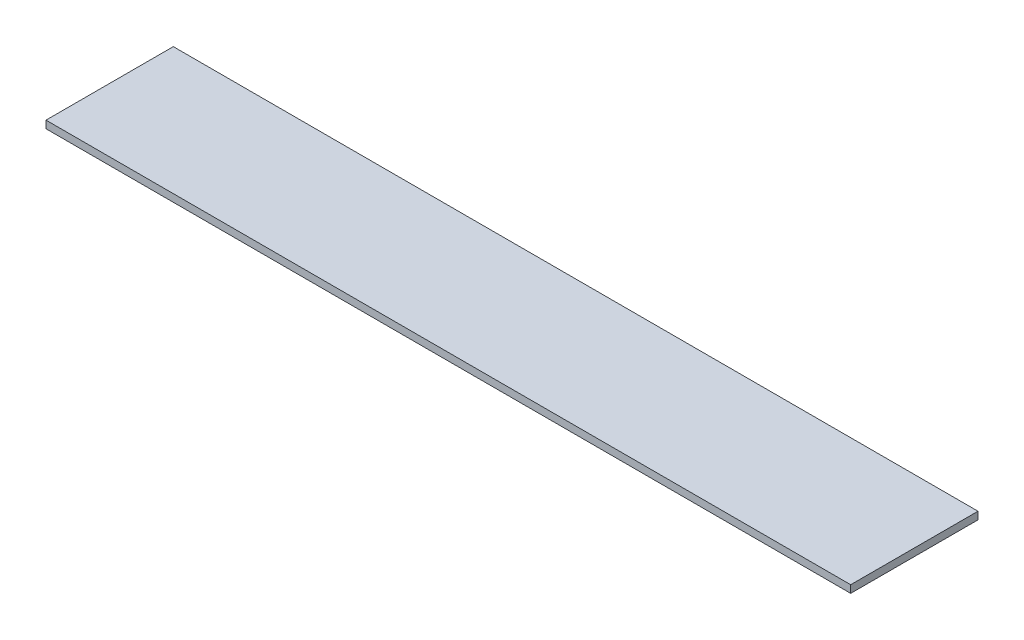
ISO-10303-21;
HEADER;
FILE_DESCRIPTION(('STEP AP214'),'2;1');
FILE_NAME('part.step','',(''),(''),'','','');
FILE_SCHEMA(('AUTOMOTIVE_DESIGN { 1 0 10303 214 1 1 1 1 }'));
ENDSEC;
DATA;
#1=APPLICATION_CONTEXT('core data for automotive mechanical design processes');
#2=APPLICATION_PROTOCOL_DEFINITION('international standard','automotive_design',2000,#1);
#3=PRODUCT_CONTEXT('',#1,'mechanical');
#4=PRODUCT('Part','Part','',(#3));
#5=PRODUCT_RELATED_PRODUCT_CATEGORY('part','',(#4));
#6=PRODUCT_DEFINITION_FORMATION('','',#4);
#7=PRODUCT_DEFINITION_CONTEXT('part definition',#1,'design');
#8=PRODUCT_DEFINITION('design','',#6,#7);
#9=PRODUCT_DEFINITION_SHAPE('','',#8);
#10=(LENGTH_UNIT() NAMED_UNIT(*) SI_UNIT(.MILLI.,.METRE.));
#11=(NAMED_UNIT(*) PLANE_ANGLE_UNIT() SI_UNIT($,.RADIAN.));
#12=(NAMED_UNIT(*) SI_UNIT($,.STERADIAN.) SOLID_ANGLE_UNIT());
#13=UNCERTAINTY_MEASURE_WITH_UNIT(LENGTH_MEASURE(1.E-05),#10,'distance_accuracy_value','');
#14=(GEOMETRIC_REPRESENTATION_CONTEXT(3) GLOBAL_UNCERTAINTY_ASSIGNED_CONTEXT((#13)) GLOBAL_UNIT_ASSIGNED_CONTEXT((#10,
#11,#12)) REPRESENTATION_CONTEXT('',''));
#15=CARTESIAN_POINT('',(0.,0.,0.));
#16=DIRECTION('',(0.,0.,1.));
#17=DIRECTION('',(1.,0.,0.));
#18=AXIS2_PLACEMENT_3D('',#15,#16,#17);
#19=CARTESIAN_POINT('',(0.,0.,26.924));
#20=DIRECTION('',(0.,0.,1.));
#21=DIRECTION('',(1.,0.,0.));
#22=AXIS2_PLACEMENT_3D('',#19,#20,#21);
#23=PLANE('',#22);
#24=DIRECTION('',(1.,0.,0.));
#25=VECTOR('',#24,1.);
#26=CARTESIAN_POINT('',(-209.826086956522,45.0420093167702,26.924));
#27=LINE('',#26,#25);
#28=CARTESIAN_POINT('',(-209.826086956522,45.0420093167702,26.924));
#29=VERTEX_POINT('',#28);
#30=CARTESIAN_POINT('',(-39.6460869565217,45.0420093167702,26.924));
#31=VERTEX_POINT('',#30);
#32=EDGE_CURVE('E92',#29,#31,#27,.T.);
#33=ORIENTED_EDGE('',*,*,#32,.F.);
#34=DIRECTION('',(0.,-1.,0.));
#35=VECTOR('',#34,1.);
#36=CARTESIAN_POINT('',(-209.826086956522,67.8385093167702,26.924));
#37=LINE('',#36,#35);
#38=CARTESIAN_POINT('',(-209.826086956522,43.4545093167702,26.924));
#39=VERTEX_POINT('',#38);
#40=EDGE_CURVE('E82',#29,#39,#37,.T.);
#41=ORIENTED_EDGE('',*,*,#40,.T.);
#42=DIRECTION('',(1.,0.,0.));
#43=VECTOR('',#42,1.);
#44=CARTESIAN_POINT('',(-209.826086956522,43.4545093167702,26.924));
#45=LINE('',#44,#43);
#46=CARTESIAN_POINT('',(-39.6460869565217,43.4545093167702,26.924));
#47=VERTEX_POINT('',#46);
#48=EDGE_CURVE('E54',#39,#47,#45,.T.);
#49=ORIENTED_EDGE('',*,*,#48,.T.);
#50=DIRECTION('',(0.,1.,0.));
#51=VECTOR('',#50,1.);
#52=CARTESIAN_POINT('',(-39.6460869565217,67.8385093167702,26.924));
#53=LINE('',#52,#51);
#54=EDGE_CURVE('E100',#47,#31,#53,.T.);
#55=ORIENTED_EDGE('',*,*,#54,.T.);
#56=EDGE_LOOP('',(#33,#41,#49,#55));
#57=FACE_BOUND('',#56,.T.);
#58=ADVANCED_FACE('F37',(#57),#23,.T.);
#59=CARTESIAN_POINT('',(-209.826086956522,67.8385093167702,26.924));
#60=DIRECTION('',(1.,0.,0.));
#61=DIRECTION('',(0.,0.,-1.));
#62=AXIS2_PLACEMENT_3D('',#59,#60,#61);
#63=PLANE('',#62);
#64=DIRECTION('',(0.,0.,1.));
#65=VECTOR('',#64,1.);
#66=CARTESIAN_POINT('',(-209.826086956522,45.0420093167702,-168.891741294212));
#67=LINE('',#66,#65);
#68=CARTESIAN_POINT('',(-209.826086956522,45.0420093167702,0.));
#69=VERTEX_POINT('',#68);
#70=EDGE_CURVE('E73',#69,#29,#67,.T.);
#71=ORIENTED_EDGE('',*,*,#70,.F.);
#72=DIRECTION('',(0.,-1.,0.));
#73=VECTOR('',#72,1.);
#74=CARTESIAN_POINT('',(-209.826086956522,67.8385093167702,0.));
#75=LINE('',#74,#73);
#76=CARTESIAN_POINT('',(-209.826086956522,43.4545093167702,0.));
#77=VERTEX_POINT('',#76);
#78=EDGE_CURVE('E65',#69,#77,#75,.T.);
#79=ORIENTED_EDGE('',*,*,#78,.T.);
#80=DIRECTION('',(0.,0.,-1.));
#81=VECTOR('',#80,1.);
#82=CARTESIAN_POINT('',(-209.826086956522,43.4545093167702,26.924));
#83=LINE('',#82,#81);
#84=EDGE_CURVE('E11',#39,#77,#83,.T.);
#85=ORIENTED_EDGE('',*,*,#84,.F.);
#86=ORIENTED_EDGE('',*,*,#40,.F.);
#87=EDGE_LOOP('',(#71,#79,#85,#86));
#88=FACE_BOUND('',#87,.T.);
#89=ADVANCED_FACE('F39',(#88),#63,.F.);
#90=CARTESIAN_POINT('',(-209.826086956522,43.4545093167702,26.924));
#91=DIRECTION('',(0.,1.,0.));
#92=DIRECTION('',(0.,0.,1.));
#93=AXIS2_PLACEMENT_3D('',#90,#91,#92);
#94=PLANE('',#93);
#95=DIRECTION('',(1.,0.,0.));
#96=VECTOR('',#95,1.);
#97=CARTESIAN_POINT('',(-209.826086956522,43.4545093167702,0.));
#98=LINE('',#97,#96);
#99=CARTESIAN_POINT('',(-39.6460869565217,43.4545093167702,0.));
#100=VERTEX_POINT('',#99);
#101=EDGE_CURVE('E95',#77,#100,#98,.T.);
#102=ORIENTED_EDGE('',*,*,#101,.T.);
#103=DIRECTION('',(0.,0.,-1.));
#104=VECTOR('',#103,1.);
#105=CARTESIAN_POINT('',(-39.6460869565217,43.4545093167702,26.924));
#106=LINE('',#105,#104);
#107=EDGE_CURVE('E46',#47,#100,#106,.T.);
#108=ORIENTED_EDGE('',*,*,#107,.F.);
#109=ORIENTED_EDGE('',*,*,#48,.F.);
#110=ORIENTED_EDGE('',*,*,#84,.T.);
#111=EDGE_LOOP('',(#102,#108,#109,#110));
#112=FACE_BOUND('',#111,.T.);
#113=ADVANCED_FACE('F111',(#112),#94,.F.);
#114=CARTESIAN_POINT('',(-39.6460869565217,67.8385093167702,26.924));
#115=DIRECTION('',(-1.,0.,0.));
#116=DIRECTION('',(0.,0.,1.));
#117=AXIS2_PLACEMENT_3D('',#114,#115,#116);
#118=PLANE('',#117);
#119=DIRECTION('',(0.,1.,0.));
#120=VECTOR('',#119,1.);
#121=CARTESIAN_POINT('',(-39.6460869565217,67.8385093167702,0.));
#122=LINE('',#121,#120);
#123=CARTESIAN_POINT('',(-39.6460869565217,45.0420093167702,0.));
#124=VERTEX_POINT('',#123);
#125=EDGE_CURVE('E97',#100,#124,#122,.T.);
#126=ORIENTED_EDGE('',*,*,#125,.T.);
#127=DIRECTION('',(0.,0.,1.));
#128=VECTOR('',#127,1.);
#129=CARTESIAN_POINT('',(-39.6460869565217,45.0420093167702,-168.891741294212));
#130=LINE('',#129,#128);
#131=EDGE_CURVE('E83',#124,#31,#130,.T.);
#132=ORIENTED_EDGE('',*,*,#131,.T.);
#133=ORIENTED_EDGE('',*,*,#54,.F.);
#134=ORIENTED_EDGE('',*,*,#107,.T.);
#135=EDGE_LOOP('',(#126,#132,#133,#134));
#136=FACE_BOUND('',#135,.T.);
#137=ADVANCED_FACE('F109',(#136),#118,.F.);
#138=CARTESIAN_POINT('',(0.,0.,0.));
#139=DIRECTION('',(0.,0.,1.));
#140=DIRECTION('',(1.,0.,0.));
#141=AXIS2_PLACEMENT_3D('',#138,#139,#140);
#142=PLANE('',#141);
#143=ORIENTED_EDGE('',*,*,#78,.F.);
#144=DIRECTION('',(1.,0.,0.));
#145=VECTOR('',#144,1.);
#146=CARTESIAN_POINT('',(0.,45.0420093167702,0.));
#147=LINE('',#146,#145);
#148=EDGE_CURVE('E86',#69,#124,#147,.T.);
#149=ORIENTED_EDGE('',*,*,#148,.T.);
#150=ORIENTED_EDGE('',*,*,#125,.F.);
#151=ORIENTED_EDGE('',*,*,#101,.F.);
#152=EDGE_LOOP('',(#143,#149,#150,#151));
#153=FACE_BOUND('',#152,.T.);
#154=ADVANCED_FACE('F94',(#153),#142,.F.);
#155=CARTESIAN_POINT('',(-209.826086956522,45.0420093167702,-168.891741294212));
#156=DIRECTION('',(0.,-1.,0.));
#157=DIRECTION('',(0.,0.,-1.));
#158=AXIS2_PLACEMENT_3D('',#155,#156,#157);
#159=PLANE('',#158);
#160=ORIENTED_EDGE('',*,*,#70,.T.);
#161=ORIENTED_EDGE('',*,*,#32,.T.);
#162=ORIENTED_EDGE('',*,*,#131,.F.);
#163=ORIENTED_EDGE('',*,*,#148,.F.);
#164=EDGE_LOOP('',(#160,#161,#162,#163));
#165=FACE_BOUND('',#164,.T.);
#166=ADVANCED_FACE('F87',(#165),#159,.F.);
#167=CLOSED_SHELL('',(#58,#89,#113,#137,#154,#166));
#168=MANIFOLD_SOLID_BREP('B2',#167);
#169=ADVANCED_BREP_SHAPE_REPRESENTATION('',(#18,#168),#14);
#170=SHAPE_DEFINITION_REPRESENTATION(#9,#169);
ENDSEC;
END-ISO-10303-21;
